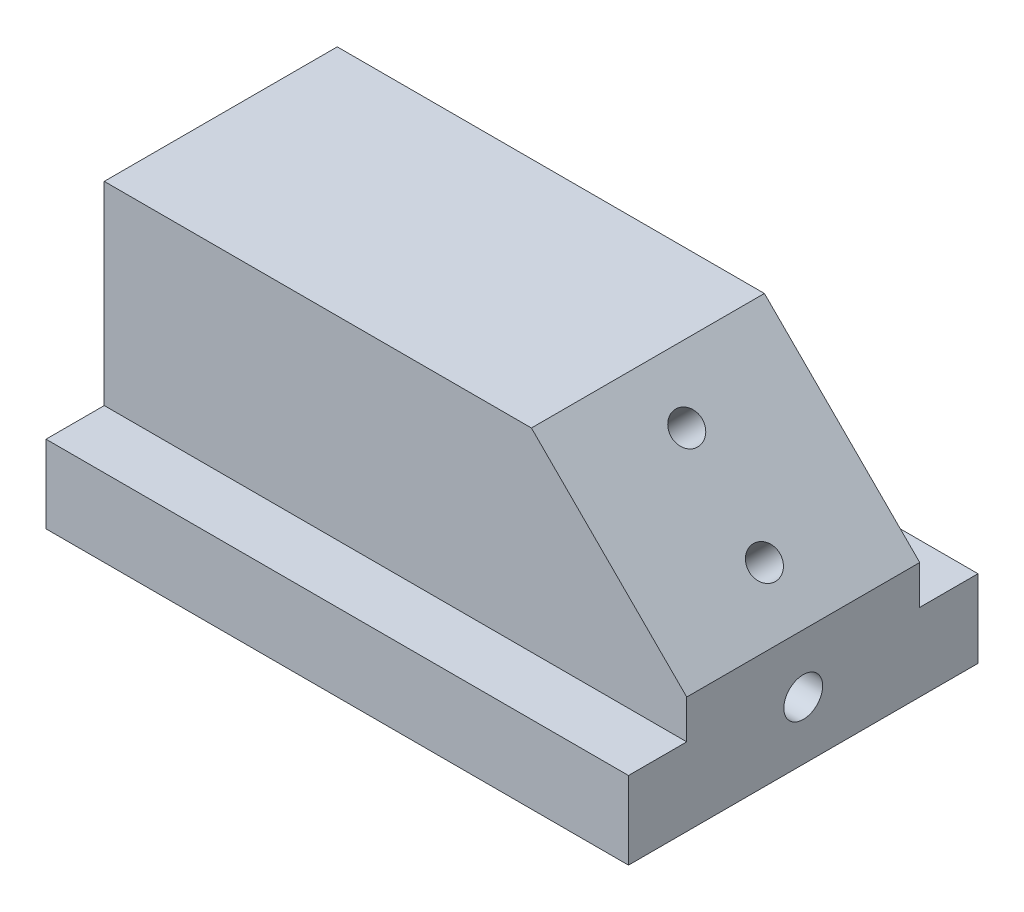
from build123d import *

# Parameters (mm, degrees)
BOSS_EXTRUDE1_DEPTH          = 60
F_8_0_8_DIAMETER_HOLE2_D     = 8
F_8_0_8_DIAMETER_HOLE2_DEPTH = 15
F_8_0_8_DIAMETER_HOLE2_TIP   = 2.403442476
SKETCH7_W                    = 15
SKETCH7_H                    = 20
BOSS_EXTRUDE2_DEPTH          = 150
SKETCH8_R                    = 5
CUT_EXTRUDE1_DEPTH           = 20


with BuildPart() as part:
    # Sketch1 → Boss-Extrude1 (new body)
    with BuildSketch(Plane.XY):
        Polygon((0, 0), (40, -40), (40, -70), (-110, -70), (-110, 0), align=None)
    extrude(amount=BOSS_EXTRUDE1_DEPTH)

    # 8.0 _8_ Diameter Hole2
    with Locations(Plane(origin=(0, 0, 0), x_dir=(0.7071067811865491, -0.707106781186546, 0), z_dir=(0.707106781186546, 0.7071067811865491, 0))):
        with Locations((14.142135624, -30), (42.426406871, -30)):
            Hole(F_8_0_8_DIAMETER_HOLE2_D / 2, depth=F_8_0_8_DIAMETER_HOLE2_DEPTH)
            with Locations((0, 0, -(F_8_0_8_DIAMETER_HOLE2_DEPTH + F_8_0_8_DIAMETER_HOLE2_TIP / 2))):  # 118° drill point
                Cone(0, F_8_0_8_DIAMETER_HOLE2_D / 2, F_8_0_8_DIAMETER_HOLE2_TIP, mode=Mode.SUBTRACT)

    # Sketch7 → Boss-Extrude2 (add)
    with BuildSketch(Plane(origin=(40, 0, 0), x_dir=(0, 0, -1), z_dir=(1, 0, 0))):
        with Locations((7.5, -60)):
            Rectangle(SKETCH7_W, SKETCH7_H)
        with Locations((-67.5, -60)):
            Rectangle(SKETCH7_W, SKETCH7_H)
    extrude(amount=-BOSS_EXTRUDE2_DEPTH)

    # Sketch8 → Cut-Extrude1 (cut)
    with BuildSketch(Plane(origin=(40, 0, 0), x_dir=(0, 0, -1), z_dir=(1, 0, 0))):
        with Locations((-30, -55)):
            Circle(SKETCH8_R)
    extrude(amount=-CUT_EXTRUDE1_DEPTH, mode=Mode.SUBTRACT)


solid = part.part
